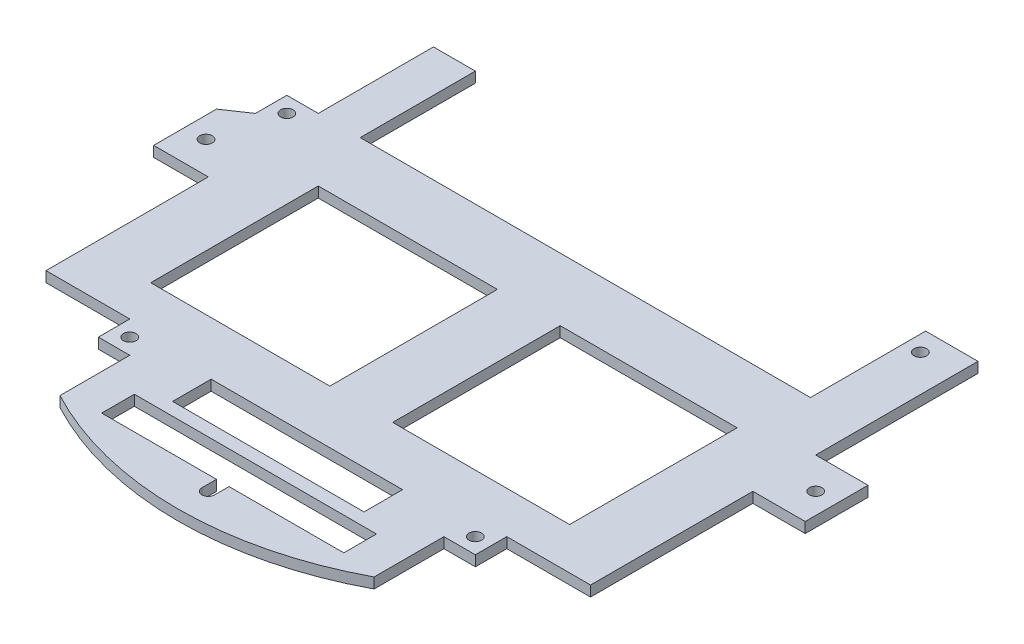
from build123d import *

# Parameters (mm, degrees)
SKIZZE1_R                       = 3
SKIZZE1_W                       = 91.4
SKIZZE1_H                       = 18.4
SKIZZE1_W_2                     = 84.479471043
SKIZZE1_H_2                     = 80
SKIZZE1_W_3                     = 85.520528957
AUFSATZ_LINEAR_AUSTRAGEN1_DEPTH = 5


with BuildPart() as part:
    # Skizze1 → Aufsatz-Linear austragen1 (new body)
    with BuildSketch(Plane(origin=(0, 0, 0), x_dir=(1, 0, 0), z_dir=(0, 1, 0))):
        with BuildLine():
            Line((-130, 92.5), (-110, 92.5))
            Line((-110, 92.5), (-110, 62.617705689))
            Line((-110, 62.617705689), (-110, 37.5))
            Line((-110, 37.5), (-90, 37.5))
            Line((-90, 37.5), (90, 37.5))
            Line((90, 37.5), (105, 37.5))
            Line((105, 37.5), (105, 57.5))
            Line((105, 57.5), (105, 92.5))
            Line((105, 92.5), (130, 92.5))
            Line((130, 92.5), (130, 41.196807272))
            Line((130, 41.196807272), (130, 15))
            Line((130, 15), (155, 15))
            Line((155, 15), (155, -15))
            Line((155, -15), (130, -15))
            Line((130, -15), (130, -92.5))
            Line((130, -92.5), (90, -92.5))
            Line((90, -92.5), (90, -107.5))
            Line((90, -107.5), (75, -107.5))
            Line((75, -107.5), (75, -140.823471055))
            ThreePointArc((75, -140.823471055), (0, -159.550148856), (-75, -140.823471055))
            Line((-75, -140.823471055), (-75, -107.5))
            Line((-75, -107.5), (-90, -107.5))
            Line((-90, -107.5), (-90, -92.5))
            Line((-90, -92.5), (-130, -92.5))
            Line((-130, -92.5), (-130, -15))
            Line((-130, -15), (-156.087895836, -15))
            Line((-156.087895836, -15), (-156.087895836, 15))
            Line((-156.087895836, 15), (-145, 22.5))
            Line((-145, 22.5), (-145, 37.5))
            Line((-145, 37.5), (-130, 37.5))
            Line((-130, 37.5), (-130, 92.5))
        make_face()
        with Locations(Location((-137.5, 30, 0), (0, 0, 270))):
            Circle(SKIZZE1_R, mode=Mode.SUBTRACT)
        with Locations(Location((112.5, 82.5, 0), (0, 0, 270))):
            Circle(SKIZZE1_R, mode=Mode.SUBTRACT)
        with Locations(Location((82.5, -100, 0), (0, 0, 270))):
            Circle(SKIZZE1_R, mode=Mode.SUBTRACT)
        with Locations(Location((-82.5, -100, 0), (0, 0, 270))):
            Circle(SKIZZE1_R, mode=Mode.SUBTRACT)
        with Locations(Location((-146.087895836, 0, 0), (0, 0, 270))):
            Circle(SKIZZE1_R, mode=Mode.SUBTRACT)
        with Locations(Location((145, 0, 0), (0, 0, 270))):
            Circle(SKIZZE1_R, mode=Mode.SUBTRACT)
        with Locations((0, -107.163021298)):
            Rectangle(SKIZZE1_W, SKIZZE1_H, mode=Mode.SUBTRACT)
        with Locations((57.760264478, -32.5)):
            Rectangle(SKIZZE1_W_2, SKIZZE1_H_2, mode=Mode.SUBTRACT)
        with BuildLine():
            Line((-3, -145.026959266), (-3, -138.110637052))
            Line((-3, -138.110637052), (-57.8, -138.110637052))
            Line((-57.8, -138.110637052), (-57.8, -122.510637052))
            Line((-57.8, -122.510637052), (57.8, -122.510637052))
            Line((57.8, -122.510637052), (57.8, -138.110637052))
            Line((57.8, -138.110637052), (3, -138.110637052))
            Line((3, -138.110637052), (3, -145.026959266))
            ThreePointArc((3, -145.026959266), (0, -148.026959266), (-3, -145.026959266))
        make_face(mode=Mode.SUBTRACT)
        with Locations((-57.239735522, -32.5)):
            Rectangle(SKIZZE1_W_3, SKIZZE1_H_2, mode=Mode.SUBTRACT)
    extrude(amount=AUFSATZ_LINEAR_AUSTRAGEN1_DEPTH)


solid = part.part
